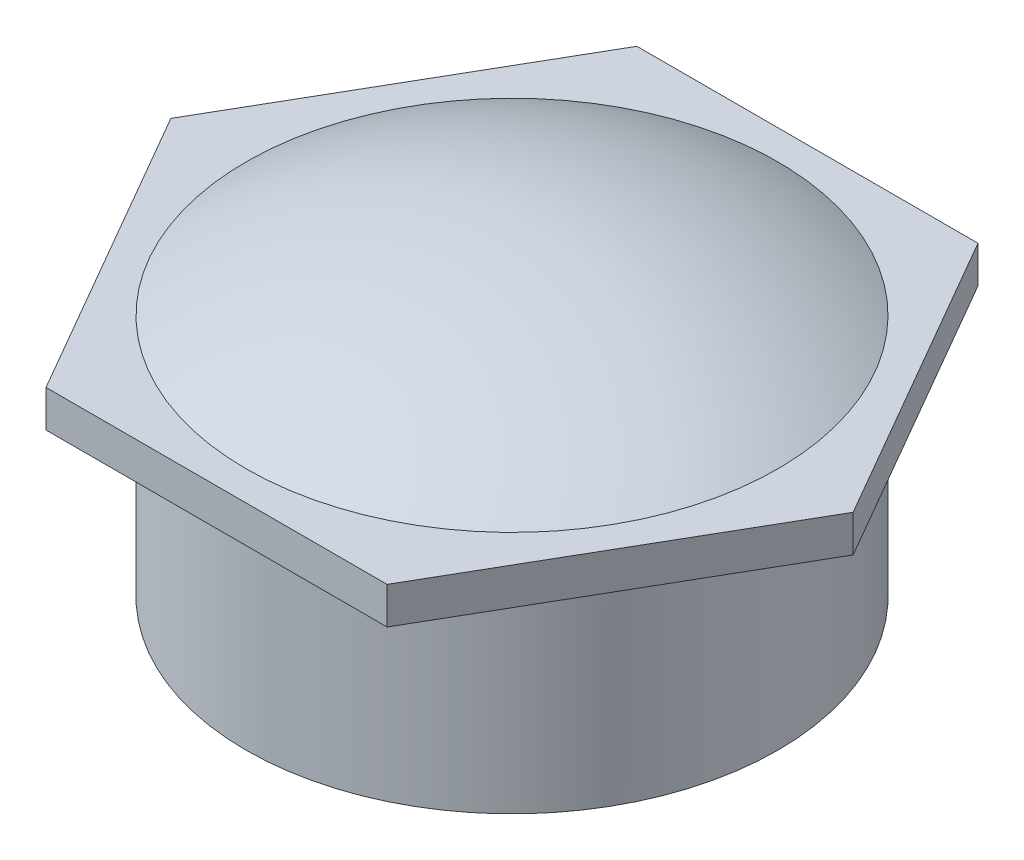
ISO-10303-21;
HEADER;
FILE_DESCRIPTION(('STEP AP214'),'2;1');
FILE_NAME('part.step','',(''),(''),'','','');
FILE_SCHEMA(('AUTOMOTIVE_DESIGN { 1 0 10303 214 1 1 1 1 }'));
ENDSEC;
DATA;
#1=APPLICATION_CONTEXT('core data for automotive mechanical design processes');
#2=APPLICATION_PROTOCOL_DEFINITION('international standard','automotive_design',2000,#1);
#3=PRODUCT_CONTEXT('',#1,'mechanical');
#4=PRODUCT('Part','Part','',(#3));
#5=PRODUCT_RELATED_PRODUCT_CATEGORY('part','',(#4));
#6=PRODUCT_DEFINITION_FORMATION('','',#4);
#7=PRODUCT_DEFINITION_CONTEXT('part definition',#1,'design');
#8=PRODUCT_DEFINITION('design','',#6,#7);
#9=PRODUCT_DEFINITION_SHAPE('','',#8);
#10=(LENGTH_UNIT() NAMED_UNIT(*) SI_UNIT(.MILLI.,.METRE.));
#11=(NAMED_UNIT(*) PLANE_ANGLE_UNIT() SI_UNIT($,.RADIAN.));
#12=(NAMED_UNIT(*) SI_UNIT($,.STERADIAN.) SOLID_ANGLE_UNIT());
#13=UNCERTAINTY_MEASURE_WITH_UNIT(LENGTH_MEASURE(1.E-05),#10,'distance_accuracy_value','');
#14=(GEOMETRIC_REPRESENTATION_CONTEXT(3) GLOBAL_UNCERTAINTY_ASSIGNED_CONTEXT((#13)) GLOBAL_UNIT_ASSIGNED_CONTEXT((#10,
#11,#12)) REPRESENTATION_CONTEXT('',''));
#15=CARTESIAN_POINT('',(0.,0.,0.));
#16=DIRECTION('',(0.,0.,1.));
#17=DIRECTION('',(1.,0.,0.));
#18=AXIS2_PLACEMENT_3D('',#15,#16,#17);
#19=CARTESIAN_POINT('',(0.,2.5,0.));
#20=DIRECTION('',(0.,1.,0.));
#21=DIRECTION('',(0.,0.,1.));
#22=AXIS2_PLACEMENT_3D('',#19,#20,#21);
#23=PLANE('',#22);
#24=DIRECTION('',(0.5,0.,-0.866025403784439));
#25=VECTOR('',#24,1.);
#26=CARTESIAN_POINT('',(11.5470053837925,2.5,20.));
#27=LINE('',#26,#25);
#28=CARTESIAN_POINT('',(11.5470053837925,2.5,20.));
#29=VERTEX_POINT('',#28);
#30=CARTESIAN_POINT('',(23.094010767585,2.5,0.));
#31=VERTEX_POINT('',#30);
#32=EDGE_CURVE('E139',#29,#31,#27,.T.);
#33=ORIENTED_EDGE('',*,*,#32,.T.);
#34=DIRECTION('',(-0.5,0.,-0.866025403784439));
#35=VECTOR('',#34,1.);
#36=CARTESIAN_POINT('',(23.094010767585,2.5,0.));
#37=LINE('',#36,#35);
#38=CARTESIAN_POINT('',(11.5470053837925,2.5,-20.));
#39=VERTEX_POINT('',#38);
#40=EDGE_CURVE('E97',#31,#39,#37,.T.);
#41=ORIENTED_EDGE('',*,*,#40,.T.);
#42=DIRECTION('',(-1.,0.,0.));
#43=VECTOR('',#42,1.);
#44=CARTESIAN_POINT('',(11.5470053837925,2.5,-20.));
#45=LINE('',#44,#43);
#46=CARTESIAN_POINT('',(-11.5470053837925,2.5,-20.));
#47=VERTEX_POINT('',#46);
#48=EDGE_CURVE('E110',#39,#47,#45,.T.);
#49=ORIENTED_EDGE('',*,*,#48,.T.);
#50=DIRECTION('',(-0.5,0.,0.866025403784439));
#51=VECTOR('',#50,1.);
#52=CARTESIAN_POINT('',(-11.5470053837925,2.5,-20.));
#53=LINE('',#52,#51);
#54=CARTESIAN_POINT('',(-23.094010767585,2.5,0.));
#55=VERTEX_POINT('',#54);
#56=EDGE_CURVE('E104',#47,#55,#53,.T.);
#57=ORIENTED_EDGE('',*,*,#56,.T.);
#58=DIRECTION('',(0.5,0.,0.866025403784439));
#59=VECTOR('',#58,1.);
#60=CARTESIAN_POINT('',(-23.094010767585,2.5,0.));
#61=LINE('',#60,#59);
#62=CARTESIAN_POINT('',(-11.5470053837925,2.5,20.));
#63=VERTEX_POINT('',#62);
#64=EDGE_CURVE('E108',#55,#63,#61,.T.);
#65=ORIENTED_EDGE('',*,*,#64,.T.);
#66=DIRECTION('',(1.,0.,0.));
#67=VECTOR('',#66,1.);
#68=CARTESIAN_POINT('',(-11.5470053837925,2.5,20.));
#69=LINE('',#68,#67);
#70=EDGE_CURVE('E59',#63,#29,#69,.T.);
#71=ORIENTED_EDGE('',*,*,#70,.T.);
#72=EDGE_LOOP('',(#33,#41,#49,#57,#65,#71));
#73=FACE_BOUND('',#72,.T.);
#74=CARTESIAN_POINT('',(0.,2.5,0.));
#75=DIRECTION('',(0.,1.,0.));
#76=DIRECTION('',(0.,0.,1.));
#77=AXIS2_PLACEMENT_3D('',#74,#75,#76);
#78=CIRCLE('',#77,18.);
#79=CARTESIAN_POINT('',(0.,2.5,18.));
#80=VERTEX_POINT('',#79);
#81=EDGE_CURVE('E51',#80,#80,#78,.F.);
#82=ORIENTED_EDGE('',*,*,#81,.T.);
#83=EDGE_LOOP('',(#82));
#84=FACE_BOUND('',#83,.T.);
#85=ADVANCED_FACE('F42',(#73,#84),#23,.T.);
#86=CARTESIAN_POINT('',(11.5470053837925,2.5,20.));
#87=DIRECTION('',(-0.866025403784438,0.,-0.5));
#88=DIRECTION('',(-0.5,0.,0.866025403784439));
#89=AXIS2_PLACEMENT_3D('',#86,#87,#88);
#90=PLANE('',#89);
#91=DIRECTION('',(0.5,0.,-0.866025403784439));
#92=VECTOR('',#91,1.);
#93=CARTESIAN_POINT('',(11.5470053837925,0.,20.));
#94=LINE('',#93,#92);
#95=CARTESIAN_POINT('',(11.5470053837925,0.,20.));
#96=VERTEX_POINT('',#95);
#97=CARTESIAN_POINT('',(23.094010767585,0.,0.));
#98=VERTEX_POINT('',#97);
#99=EDGE_CURVE('E128',#96,#98,#94,.T.);
#100=ORIENTED_EDGE('',*,*,#99,.T.);
#101=DIRECTION('',(0.,-1.,0.));
#102=VECTOR('',#101,1.);
#103=CARTESIAN_POINT('',(23.094010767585,2.5,0.));
#104=LINE('',#103,#102);
#105=EDGE_CURVE('E146',#31,#98,#104,.T.);
#106=ORIENTED_EDGE('',*,*,#105,.F.);
#107=ORIENTED_EDGE('',*,*,#32,.F.);
#108=DIRECTION('',(0.,-1.,0.));
#109=VECTOR('',#108,1.);
#110=CARTESIAN_POINT('',(11.5470053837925,2.5,20.));
#111=LINE('',#110,#109);
#112=EDGE_CURVE('E124',#29,#96,#111,.T.);
#113=ORIENTED_EDGE('',*,*,#112,.T.);
#114=EDGE_LOOP('',(#100,#106,#107,#113));
#115=FACE_BOUND('',#114,.T.);
#116=ADVANCED_FACE('F166',(#115),#90,.F.);
#117=CARTESIAN_POINT('',(23.094010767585,2.5,0.));
#118=DIRECTION('',(-0.866025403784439,0.,0.5));
#119=DIRECTION('',(0.5,0.,0.866025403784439));
#120=AXIS2_PLACEMENT_3D('',#117,#118,#119);
#121=PLANE('',#120);
#122=DIRECTION('',(-0.5,0.,-0.866025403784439));
#123=VECTOR('',#122,1.);
#124=CARTESIAN_POINT('',(23.094010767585,0.,0.));
#125=LINE('',#124,#123);
#126=CARTESIAN_POINT('',(11.5470053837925,0.,-20.));
#127=VERTEX_POINT('',#126);
#128=EDGE_CURVE('E131',#98,#127,#125,.T.);
#129=ORIENTED_EDGE('',*,*,#128,.T.);
#130=DIRECTION('',(0.,-1.,0.));
#131=VECTOR('',#130,1.);
#132=CARTESIAN_POINT('',(11.5470053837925,2.5,-20.));
#133=LINE('',#132,#131);
#134=EDGE_CURVE('E143',#39,#127,#133,.T.);
#135=ORIENTED_EDGE('',*,*,#134,.F.);
#136=ORIENTED_EDGE('',*,*,#40,.F.);
#137=ORIENTED_EDGE('',*,*,#105,.T.);
#138=EDGE_LOOP('',(#129,#135,#136,#137));
#139=FACE_BOUND('',#138,.T.);
#140=ADVANCED_FACE('F171',(#139),#121,.F.);
#141=CARTESIAN_POINT('',(11.5470053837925,2.5,-20.));
#142=DIRECTION('',(0.,0.,1.));
#143=DIRECTION('',(1.,0.,0.));
#144=AXIS2_PLACEMENT_3D('',#141,#142,#143);
#145=PLANE('',#144);
#146=DIRECTION('',(-1.,0.,0.));
#147=VECTOR('',#146,1.);
#148=CARTESIAN_POINT('',(11.5470053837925,0.,-20.));
#149=LINE('',#148,#147);
#150=CARTESIAN_POINT('',(-11.5470053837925,0.,-20.));
#151=VERTEX_POINT('',#150);
#152=EDGE_CURVE('E134',#127,#151,#149,.T.);
#153=ORIENTED_EDGE('',*,*,#152,.T.);
#154=DIRECTION('',(0.,-1.,0.));
#155=VECTOR('',#154,1.);
#156=CARTESIAN_POINT('',(-11.5470053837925,2.5,-20.));
#157=LINE('',#156,#155);
#158=EDGE_CURVE('E119',#47,#151,#157,.T.);
#159=ORIENTED_EDGE('',*,*,#158,.F.);
#160=ORIENTED_EDGE('',*,*,#48,.F.);
#161=ORIENTED_EDGE('',*,*,#134,.T.);
#162=EDGE_LOOP('',(#153,#159,#160,#161));
#163=FACE_BOUND('',#162,.T.);
#164=ADVANCED_FACE('F181',(#163),#145,.F.);
#165=CARTESIAN_POINT('',(-11.5470053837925,2.5,-20.));
#166=DIRECTION('',(0.866025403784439,0.,0.5));
#167=DIRECTION('',(0.5,0.,-0.866025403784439));
#168=AXIS2_PLACEMENT_3D('',#165,#166,#167);
#169=PLANE('',#168);
#170=DIRECTION('',(-0.5,0.,0.866025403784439));
#171=VECTOR('',#170,1.);
#172=CARTESIAN_POINT('',(-11.5470053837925,0.,-20.));
#173=LINE('',#172,#171);
#174=CARTESIAN_POINT('',(-23.094010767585,0.,0.));
#175=VERTEX_POINT('',#174);
#176=EDGE_CURVE('E118',#151,#175,#173,.T.);
#177=ORIENTED_EDGE('',*,*,#176,.T.);
#178=DIRECTION('',(0.,-1.,0.));
#179=VECTOR('',#178,1.);
#180=CARTESIAN_POINT('',(-23.094010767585,2.5,0.));
#181=LINE('',#180,#179);
#182=EDGE_CURVE('E115',#55,#175,#181,.T.);
#183=ORIENTED_EDGE('',*,*,#182,.F.);
#184=ORIENTED_EDGE('',*,*,#56,.F.);
#185=ORIENTED_EDGE('',*,*,#158,.T.);
#186=EDGE_LOOP('',(#177,#183,#184,#185));
#187=FACE_BOUND('',#186,.T.);
#188=ADVANCED_FACE('F116',(#187),#169,.F.);
#189=CARTESIAN_POINT('',(-23.094010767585,2.5,0.));
#190=DIRECTION('',(0.866025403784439,0.,-0.5));
#191=DIRECTION('',(-0.5,0.,-0.866025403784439));
#192=AXIS2_PLACEMENT_3D('',#189,#190,#191);
#193=PLANE('',#192);
#194=DIRECTION('',(0.5,0.,0.866025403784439));
#195=VECTOR('',#194,1.);
#196=CARTESIAN_POINT('',(-23.094010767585,0.,0.));
#197=LINE('',#196,#195);
#198=CARTESIAN_POINT('',(-11.5470053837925,0.,20.));
#199=VERTEX_POINT('',#198);
#200=EDGE_CURVE('E82',#175,#199,#197,.T.);
#201=ORIENTED_EDGE('',*,*,#200,.T.);
#202=DIRECTION('',(0.,-1.,0.));
#203=VECTOR('',#202,1.);
#204=CARTESIAN_POINT('',(-11.5470053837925,2.5,20.));
#205=LINE('',#204,#203);
#206=EDGE_CURVE('E120',#63,#199,#205,.T.);
#207=ORIENTED_EDGE('',*,*,#206,.F.);
#208=ORIENTED_EDGE('',*,*,#64,.F.);
#209=ORIENTED_EDGE('',*,*,#182,.T.);
#210=EDGE_LOOP('',(#201,#207,#208,#209));
#211=FACE_BOUND('',#210,.T.);
#212=ADVANCED_FACE('F122',(#211),#193,.F.);
#213=CARTESIAN_POINT('',(-11.5470053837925,2.5,20.));
#214=DIRECTION('',(0.,0.,-1.));
#215=DIRECTION('',(-1.,0.,0.));
#216=AXIS2_PLACEMENT_3D('',#213,#214,#215);
#217=PLANE('',#216);
#218=DIRECTION('',(1.,0.,0.));
#219=VECTOR('',#218,1.);
#220=CARTESIAN_POINT('',(-11.5470053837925,0.,20.));
#221=LINE('',#220,#219);
#222=EDGE_CURVE('E88',#199,#96,#221,.T.);
#223=ORIENTED_EDGE('',*,*,#222,.T.);
#224=ORIENTED_EDGE('',*,*,#112,.F.);
#225=ORIENTED_EDGE('',*,*,#70,.F.);
#226=ORIENTED_EDGE('',*,*,#206,.T.);
#227=EDGE_LOOP('',(#223,#224,#225,#226));
#228=FACE_BOUND('',#227,.T.);
#229=ADVANCED_FACE('F155',(#228),#217,.F.);
#230=CARTESIAN_POINT('',(0.,-27.4,0.));
#231=DIRECTION('',(0.,0.,1.));
#232=DIRECTION('',(1.,0.,0.));
#233=AXIS2_PLACEMENT_3D('',#230,#231,#232);
#234=SPHERICAL_SURFACE('',#233,34.9);
#235=CARTESIAN_POINT('',(0.,-27.4,0.));
#236=DIRECTION('',(0.,1.,0.));
#237=DIRECTION('',(0.,0.,1.));
#238=AXIS2_PLACEMENT_3D('',#235,#236,#237);
#239=SPHERICAL_SURFACE('',#238,34.9);
#240=ORIENTED_EDGE('',*,*,#81,.F.);
#241=EDGE_LOOP('',(#240));
#242=FACE_BOUND('',#241,.T.);
#243=ADVANCED_FACE('F44',(#242),#239,.T.);
#244=CARTESIAN_POINT('',(0.,0.,0.));
#245=DIRECTION('',(0.,1.,0.));
#246=DIRECTION('',(0.,0.,1.));
#247=AXIS2_PLACEMENT_3D('',#244,#245,#246);
#248=PLANE('',#247);
#249=CARTESIAN_POINT('',(0.,0.,0.));
#250=DIRECTION('',(0.,1.,0.));
#251=DIRECTION('',(0.,0.,1.));
#252=AXIS2_PLACEMENT_3D('',#249,#250,#251);
#253=CIRCLE('',#252,18.);
#254=CARTESIAN_POINT('',(0.,0.,18.));
#255=VERTEX_POINT('',#254);
#256=EDGE_CURVE('E12',#255,#255,#253,.F.);
#257=ORIENTED_EDGE('',*,*,#256,.F.);
#258=EDGE_LOOP('',(#257));
#259=FACE_BOUND('',#258,.T.);
#260=ORIENTED_EDGE('',*,*,#99,.F.);
#261=ORIENTED_EDGE('',*,*,#222,.F.);
#262=ORIENTED_EDGE('',*,*,#200,.F.);
#263=ORIENTED_EDGE('',*,*,#176,.F.);
#264=ORIENTED_EDGE('',*,*,#152,.F.);
#265=ORIENTED_EDGE('',*,*,#128,.F.);
#266=EDGE_LOOP('',(#260,#261,#262,#263,#264,#265));
#267=FACE_BOUND('',#266,.T.);
#268=ADVANCED_FACE('F154',(#259,#267),#248,.F.);
#269=CARTESIAN_POINT('',(0.,-14.,0.));
#270=DIRECTION('',(0.,-1.,0.));
#271=DIRECTION('',(0.,0.,-1.));
#272=AXIS2_PLACEMENT_3D('',#269,#270,#271);
#273=PLANE('',#272);
#274=CARTESIAN_POINT('',(0.,-14.,0.));
#275=DIRECTION('',(0.,-1.,0.));
#276=DIRECTION('',(0.,0.,-1.));
#277=AXIS2_PLACEMENT_3D('',#274,#275,#276);
#278=CIRCLE('',#277,18.);
#279=CARTESIAN_POINT('',(0.,-14.,-18.));
#280=VERTEX_POINT('',#279);
#281=EDGE_CURVE('E132',#280,#280,#278,.T.);
#282=ORIENTED_EDGE('',*,*,#281,.T.);
#283=EDGE_LOOP('',(#282));
#284=FACE_BOUND('',#283,.T.);
#285=CARTESIAN_POINT('',(0.,-14.,0.));
#286=DIRECTION('',(0.,-1.,0.));
#287=DIRECTION('',(1.,0.,0.));
#288=AXIS2_PLACEMENT_3D('',#285,#286,#287);
#289=CIRCLE('',#288,15.);
#290=CARTESIAN_POINT('',(15.,-14.,0.));
#291=VERTEX_POINT('',#290);
#292=EDGE_CURVE('E198',#291,#291,#289,.T.);
#293=ORIENTED_EDGE('',*,*,#292,.F.);
#294=EDGE_LOOP('',(#293));
#295=FACE_BOUND('',#294,.T.);
#296=ADVANCED_FACE('F160',(#284,#295),#273,.T.);
#297=CARTESIAN_POINT('',(0.,-14.,0.));
#298=DIRECTION('',(0.,1.,0.));
#299=DIRECTION('',(0.,0.,1.));
#300=AXIS2_PLACEMENT_3D('',#297,#298,#299);
#301=CYLINDRICAL_SURFACE('',#300,18.);
#302=ORIENTED_EDGE('',*,*,#281,.F.);
#303=EDGE_LOOP('',(#302));
#304=FACE_BOUND('',#303,.T.);
#305=ORIENTED_EDGE('',*,*,#256,.T.);
#306=EDGE_LOOP('',(#305));
#307=FACE_BOUND('',#306,.T.);
#308=ADVANCED_FACE('F174',(#304,#307),#301,.T.);
#309=CARTESIAN_POINT('',(0.,-14.,0.));
#310=DIRECTION('',(0.,1.,0.));
#311=DIRECTION('',(0.,0.,1.));
#312=AXIS2_PLACEMENT_3D('',#309,#310,#311);
#313=CYLINDRICAL_SURFACE('',#312,15.);
#314=ORIENTED_EDGE('',*,*,#292,.T.);
#315=EDGE_LOOP('',(#314));
#316=FACE_BOUND('',#315,.T.);
#317=CARTESIAN_POINT('',(0.,0.,0.));
#318=DIRECTION('',(0.,-1.,0.));
#319=DIRECTION('',(1.,0.,0.));
#320=AXIS2_PLACEMENT_3D('',#317,#318,#319);
#321=CIRCLE('',#320,15.);
#322=CARTESIAN_POINT('',(15.,0.,0.));
#323=VERTEX_POINT('',#322);
#324=EDGE_CURVE('E199',#323,#323,#321,.T.);
#325=ORIENTED_EDGE('',*,*,#324,.F.);
#326=EDGE_LOOP('',(#325));
#327=FACE_BOUND('',#326,.T.);
#328=ADVANCED_FACE('F205',(#316,#327),#313,.F.);
#329=ORIENTED_EDGE('',*,*,#324,.T.);
#330=EDGE_LOOP('',(#329));
#331=FACE_BOUND('',#330,.T.);
#332=ADVANCED_FACE('F163',(#331),#248,.F.);
#333=CLOSED_SHELL('',(#85,#116,#140,#164,#188,#212,#229,#243,#268,#296,#308,#328,#332));
#334=MANIFOLD_SOLID_BREP('B2',#333);
#335=ADVANCED_BREP_SHAPE_REPRESENTATION('',(#18,#334),#14);
#336=SHAPE_DEFINITION_REPRESENTATION(#9,#335);
ENDSEC;
END-ISO-10303-21;
